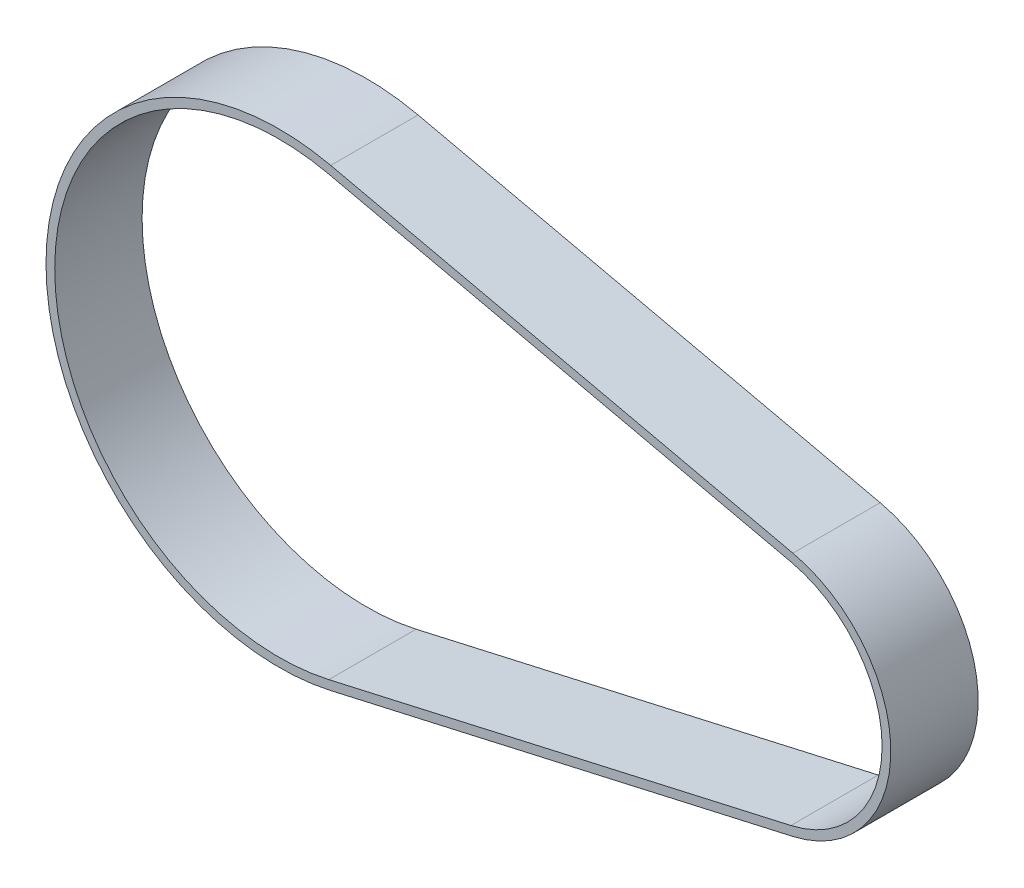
ISO-10303-21;
HEADER;
FILE_DESCRIPTION(('STEP AP214'),'2;1');
FILE_NAME('part.step','',(''),(''),'','','');
FILE_SCHEMA(('AUTOMOTIVE_DESIGN { 1 0 10303 214 1 1 1 1 }'));
ENDSEC;
DATA;
#1=APPLICATION_CONTEXT('core data for automotive mechanical design processes');
#2=APPLICATION_PROTOCOL_DEFINITION('international standard','automotive_design',2000,#1);
#3=PRODUCT_CONTEXT('',#1,'mechanical');
#4=PRODUCT('Part','Part','',(#3));
#5=PRODUCT_RELATED_PRODUCT_CATEGORY('part','',(#4));
#6=PRODUCT_DEFINITION_FORMATION('','',#4);
#7=PRODUCT_DEFINITION_CONTEXT('part definition',#1,'design');
#8=PRODUCT_DEFINITION('design','',#6,#7);
#9=PRODUCT_DEFINITION_SHAPE('','',#8);
#10=(LENGTH_UNIT() NAMED_UNIT(*) SI_UNIT(.MILLI.,.METRE.));
#11=(NAMED_UNIT(*) PLANE_ANGLE_UNIT() SI_UNIT($,.RADIAN.));
#12=(NAMED_UNIT(*) SI_UNIT($,.STERADIAN.) SOLID_ANGLE_UNIT());
#13=UNCERTAINTY_MEASURE_WITH_UNIT(LENGTH_MEASURE(1.E-05),#10,'distance_accuracy_value','');
#14=(GEOMETRIC_REPRESENTATION_CONTEXT(3) GLOBAL_UNCERTAINTY_ASSIGNED_CONTEXT((#13)) GLOBAL_UNIT_ASSIGNED_CONTEXT((#10,
#11,#12)) REPRESENTATION_CONTEXT('',''));
#15=CARTESIAN_POINT('',(0.,0.,0.));
#16=DIRECTION('',(0.,0.,1.));
#17=DIRECTION('',(1.,0.,0.));
#18=AXIS2_PLACEMENT_3D('',#15,#16,#17);
#19=CARTESIAN_POINT('',(0.,0.,0.));
#20=DIRECTION('',(0.,0.,1.));
#21=DIRECTION('',(1.,0.,0.));
#22=AXIS2_PLACEMENT_3D('',#19,#20,#21);
#23=CYLINDRICAL_SURFACE('',#22,26.6930054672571);
#24=CARTESIAN_POINT('',(0.,0.,10.));
#25=DIRECTION('',(0.,0.,1.));
#26=DIRECTION('',(1.,0.,0.));
#27=AXIS2_PLACEMENT_3D('',#24,#25,#26);
#28=CIRCLE('',#27,26.6930054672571);
#29=CARTESIAN_POINT('',(5.90067497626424,26.0326444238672,10.));
#30=VERTEX_POINT('',#29);
#31=CARTESIAN_POINT('',(5.90067497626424,-26.0326444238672,10.));
#32=VERTEX_POINT('',#31);
#33=EDGE_CURVE('E129',#30,#32,#28,.T.);
#34=ORIENTED_EDGE('',*,*,#33,.F.);
#35=DIRECTION('',(0.,0.,1.));
#36=VECTOR('',#35,1.);
#37=CARTESIAN_POINT('',(5.90067497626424,26.0326444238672,0.));
#38=LINE('',#37,#36);
#39=CARTESIAN_POINT('',(5.90067497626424,26.0326444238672,0.));
#40=VERTEX_POINT('',#39);
#41=EDGE_CURVE('E11',#40,#30,#38,.T.);
#42=ORIENTED_EDGE('',*,*,#41,.F.);
#43=CARTESIAN_POINT('',(0.,0.,0.));
#44=DIRECTION('',(0.,0.,1.));
#45=DIRECTION('',(1.,0.,0.));
#46=AXIS2_PLACEMENT_3D('',#43,#44,#45);
#47=CIRCLE('',#46,26.6930054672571);
#48=CARTESIAN_POINT('',(5.90067497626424,-26.0326444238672,0.));
#49=VERTEX_POINT('',#48);
#50=EDGE_CURVE('E133',#40,#49,#47,.T.);
#51=ORIENTED_EDGE('',*,*,#50,.T.);
#52=DIRECTION('',(0.,0.,1.));
#53=VECTOR('',#52,1.);
#54=CARTESIAN_POINT('',(5.90067497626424,-26.0326444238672,0.));
#55=LINE('',#54,#53);
#56=EDGE_CURVE('E34',#49,#32,#55,.T.);
#57=ORIENTED_EDGE('',*,*,#56,.T.);
#58=EDGE_LOOP('',(#34,#42,#51,#57));
#59=FACE_BOUND('',#58,.T.);
#60=ADVANCED_FACE('F31',(#59),#23,.T.);
#61=CARTESIAN_POINT('',(58.7992391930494,14.0424205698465,0.));
#62=DIRECTION('',(0.221056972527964,0.975260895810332,0.));
#63=DIRECTION('',(-0.975260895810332,0.221056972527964,0.));
#64=AXIS2_PLACEMENT_3D('',#61,#62,#63);
#65=PLANE('',#64);
#66=DIRECTION('',(-0.975260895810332,0.221056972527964,0.));
#67=VECTOR('',#66,1.);
#68=CARTESIAN_POINT('',(58.7992391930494,14.0424205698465,10.));
#69=LINE('',#68,#67);
#70=CARTESIAN_POINT('',(58.7992391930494,14.0424205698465,10.));
#71=VERTEX_POINT('',#70);
#72=EDGE_CURVE('E137',#71,#30,#69,.T.);
#73=ORIENTED_EDGE('',*,*,#72,.F.);
#74=DIRECTION('',(0.,0.,1.));
#75=VECTOR('',#74,1.);
#76=CARTESIAN_POINT('',(58.7992391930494,14.0424205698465,0.));
#77=LINE('',#76,#75);
#78=CARTESIAN_POINT('',(58.7992391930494,14.0424205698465,0.));
#79=VERTEX_POINT('',#78);
#80=EDGE_CURVE('E39',#79,#71,#77,.T.);
#81=ORIENTED_EDGE('',*,*,#80,.F.);
#82=DIRECTION('',(-0.975260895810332,0.221056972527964,0.));
#83=VECTOR('',#82,1.);
#84=CARTESIAN_POINT('',(58.7992391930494,14.0424205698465,0.));
#85=LINE('',#84,#83);
#86=EDGE_CURVE('E143',#79,#40,#85,.T.);
#87=ORIENTED_EDGE('',*,*,#86,.T.);
#88=ORIENTED_EDGE('',*,*,#41,.T.);
#89=EDGE_LOOP('',(#73,#81,#87,#88));
#90=FACE_BOUND('',#89,.T.);
#91=ADVANCED_FACE('F169',(#90),#65,.T.);
#92=CARTESIAN_POINT('',(55.6163216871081,0.,0.));
#93=DIRECTION('',(0.,0.,1.));
#94=DIRECTION('',(1.,0.,0.));
#95=AXIS2_PLACEMENT_3D('',#92,#93,#94);
#96=CYLINDRICAL_SURFACE('',#95,14.3986297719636);
#97=CARTESIAN_POINT('',(55.6163216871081,0.,10.));
#98=DIRECTION('',(0.,0.,1.));
#99=DIRECTION('',(1.,0.,0.));
#100=AXIS2_PLACEMENT_3D('',#97,#98,#99);
#101=CIRCLE('',#100,14.3986297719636);
#102=CARTESIAN_POINT('',(58.7992391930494,-14.0424205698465,10.));
#103=VERTEX_POINT('',#102);
#104=EDGE_CURVE('E151',#103,#71,#101,.T.);
#105=ORIENTED_EDGE('',*,*,#104,.F.);
#106=DIRECTION('',(0.,0.,1.));
#107=VECTOR('',#106,1.);
#108=CARTESIAN_POINT('',(58.7992391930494,-14.0424205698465,0.));
#109=LINE('',#108,#107);
#110=CARTESIAN_POINT('',(58.7992391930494,-14.0424205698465,0.));
#111=VERTEX_POINT('',#110);
#112=EDGE_CURVE('E156',#111,#103,#109,.T.);
#113=ORIENTED_EDGE('',*,*,#112,.F.);
#114=CARTESIAN_POINT('',(55.6163216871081,0.,0.));
#115=DIRECTION('',(0.,0.,1.));
#116=DIRECTION('',(1.,0.,0.));
#117=AXIS2_PLACEMENT_3D('',#114,#115,#116);
#118=CIRCLE('',#117,14.3986297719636);
#119=EDGE_CURVE('E140',#111,#79,#118,.T.);
#120=ORIENTED_EDGE('',*,*,#119,.T.);
#121=ORIENTED_EDGE('',*,*,#80,.T.);
#122=EDGE_LOOP('',(#105,#113,#120,#121));
#123=FACE_BOUND('',#122,.T.);
#124=ADVANCED_FACE('F173',(#123),#96,.T.);
#125=CARTESIAN_POINT('',(5.90067497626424,-26.0326444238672,0.));
#126=DIRECTION('',(0.221056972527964,-0.975260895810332,0.));
#127=DIRECTION('',(0.975260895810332,0.221056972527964,0.));
#128=AXIS2_PLACEMENT_3D('',#125,#126,#127);
#129=PLANE('',#128);
#130=DIRECTION('',(0.975260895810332,0.221056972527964,0.));
#131=VECTOR('',#130,1.);
#132=CARTESIAN_POINT('',(5.90067497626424,-26.0326444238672,10.));
#133=LINE('',#132,#131);
#134=EDGE_CURVE('E148',#32,#103,#133,.T.);
#135=ORIENTED_EDGE('',*,*,#134,.F.);
#136=ORIENTED_EDGE('',*,*,#56,.F.);
#137=DIRECTION('',(0.975260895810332,0.221056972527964,0.));
#138=VECTOR('',#137,1.);
#139=CARTESIAN_POINT('',(5.90067497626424,-26.0326444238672,0.));
#140=LINE('',#139,#138);
#141=EDGE_CURVE('E136',#49,#111,#140,.T.);
#142=ORIENTED_EDGE('',*,*,#141,.T.);
#143=ORIENTED_EDGE('',*,*,#112,.T.);
#144=EDGE_LOOP('',(#135,#136,#142,#143));
#145=FACE_BOUND('',#144,.T.);
#146=ADVANCED_FACE('F164',(#145),#129,.T.);
#147=CARTESIAN_POINT('',(0.,0.,0.));
#148=DIRECTION('',(0.,0.,1.));
#149=DIRECTION('',(1.,0.,0.));
#150=AXIS2_PLACEMENT_3D('',#147,#148,#149);
#151=PLANE('',#150);
#152=DIRECTION('',(-0.975260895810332,0.221056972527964,0.));
#153=VECTOR('',#152,1.);
#154=CARTESIAN_POINT('',(5.67961800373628,25.0573835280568,0.));
#155=LINE('',#154,#153);
#156=CARTESIAN_POINT('',(58.5781822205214,13.0671596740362,0.));
#157=VERTEX_POINT('',#156);
#158=CARTESIAN_POINT('',(5.67961800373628,25.0573835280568,0.));
#159=VERTEX_POINT('',#158);
#160=EDGE_CURVE('E104',#157,#159,#155,.T.);
#161=ORIENTED_EDGE('',*,*,#160,.T.);
#162=CARTESIAN_POINT('',(0.,0.,0.));
#163=DIRECTION('',(0.,0.,1.));
#164=DIRECTION('',(-1.,0.,0.));
#165=AXIS2_PLACEMENT_3D('',#162,#163,#164);
#166=CIRCLE('',#165,25.693005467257);
#167=CARTESIAN_POINT('',(5.67961800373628,-25.0573835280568,0.));
#168=VERTEX_POINT('',#167);
#169=EDGE_CURVE('E98',#159,#168,#166,.T.);
#170=ORIENTED_EDGE('',*,*,#169,.T.);
#171=DIRECTION('',(0.975260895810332,0.221056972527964,0.));
#172=VECTOR('',#171,1.);
#173=CARTESIAN_POINT('',(58.5781822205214,-13.0671596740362,0.));
#174=LINE('',#173,#172);
#175=CARTESIAN_POINT('',(58.5781822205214,-13.0671596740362,0.));
#176=VERTEX_POINT('',#175);
#177=EDGE_CURVE('E107',#168,#176,#174,.T.);
#178=ORIENTED_EDGE('',*,*,#177,.T.);
#179=CARTESIAN_POINT('',(55.6163216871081,0.,0.));
#180=DIRECTION('',(0.,0.,1.));
#181=DIRECTION('',(-1.,0.,0.));
#182=AXIS2_PLACEMENT_3D('',#179,#180,#181);
#183=CIRCLE('',#182,13.3986297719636);
#184=EDGE_CURVE('E47',#176,#157,#183,.T.);
#185=ORIENTED_EDGE('',*,*,#184,.T.);
#186=EDGE_LOOP('',(#161,#170,#178,#185));
#187=FACE_BOUND('',#186,.T.);
#188=ORIENTED_EDGE('',*,*,#50,.F.);
#189=ORIENTED_EDGE('',*,*,#86,.F.);
#190=ORIENTED_EDGE('',*,*,#119,.F.);
#191=ORIENTED_EDGE('',*,*,#141,.F.);
#192=EDGE_LOOP('',(#188,#189,#190,#191));
#193=FACE_BOUND('',#192,.T.);
#194=ADVANCED_FACE('F111',(#187,#193),#151,.F.);
#195=CARTESIAN_POINT('',(0.,0.,10.));
#196=DIRECTION('',(0.,0.,1.));
#197=DIRECTION('',(1.,0.,0.));
#198=AXIS2_PLACEMENT_3D('',#195,#196,#197);
#199=PLANE('',#198);
#200=CARTESIAN_POINT('',(0.,0.,10.));
#201=DIRECTION('',(0.,0.,1.));
#202=DIRECTION('',(-1.,0.,0.));
#203=AXIS2_PLACEMENT_3D('',#200,#201,#202);
#204=CIRCLE('',#203,25.693005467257);
#205=CARTESIAN_POINT('',(5.67961800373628,25.0573835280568,10.));
#206=VERTEX_POINT('',#205);
#207=CARTESIAN_POINT('',(5.67961800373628,-25.0573835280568,10.));
#208=VERTEX_POINT('',#207);
#209=EDGE_CURVE('E55',#206,#208,#204,.T.);
#210=ORIENTED_EDGE('',*,*,#209,.F.);
#211=DIRECTION('',(-0.975260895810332,0.221056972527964,0.));
#212=VECTOR('',#211,1.);
#213=CARTESIAN_POINT('',(5.67961800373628,25.0573835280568,10.));
#214=LINE('',#213,#212);
#215=CARTESIAN_POINT('',(58.5781822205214,13.0671596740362,10.));
#216=VERTEX_POINT('',#215);
#217=EDGE_CURVE('E114',#216,#206,#214,.T.);
#218=ORIENTED_EDGE('',*,*,#217,.F.);
#219=CARTESIAN_POINT('',(55.6163216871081,0.,10.));
#220=DIRECTION('',(0.,0.,1.));
#221=DIRECTION('',(-1.,0.,0.));
#222=AXIS2_PLACEMENT_3D('',#219,#220,#221);
#223=CIRCLE('',#222,13.3986297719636);
#224=CARTESIAN_POINT('',(58.5781822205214,-13.0671596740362,10.));
#225=VERTEX_POINT('',#224);
#226=EDGE_CURVE('E117',#225,#216,#223,.T.);
#227=ORIENTED_EDGE('',*,*,#226,.F.);
#228=DIRECTION('',(0.975260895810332,0.221056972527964,0.));
#229=VECTOR('',#228,1.);
#230=CARTESIAN_POINT('',(58.5781822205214,-13.0671596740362,10.));
#231=LINE('',#230,#229);
#232=EDGE_CURVE('E123',#208,#225,#231,.T.);
#233=ORIENTED_EDGE('',*,*,#232,.F.);
#234=EDGE_LOOP('',(#210,#218,#227,#233));
#235=FACE_BOUND('',#234,.T.);
#236=ORIENTED_EDGE('',*,*,#33,.T.);
#237=ORIENTED_EDGE('',*,*,#134,.T.);
#238=ORIENTED_EDGE('',*,*,#104,.T.);
#239=ORIENTED_EDGE('',*,*,#72,.T.);
#240=EDGE_LOOP('',(#236,#237,#238,#239));
#241=FACE_BOUND('',#240,.T.);
#242=ADVANCED_FACE('F166',(#235,#241),#199,.T.);
#243=CARTESIAN_POINT('',(0.,0.,0.));
#244=DIRECTION('',(0.,0.,1.));
#245=DIRECTION('',(1.,0.,0.));
#246=AXIS2_PLACEMENT_3D('',#243,#244,#245);
#247=CYLINDRICAL_SURFACE('',#246,25.693005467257);
#248=ORIENTED_EDGE('',*,*,#209,.T.);
#249=DIRECTION('',(0.,0.,1.));
#250=VECTOR('',#249,1.);
#251=CARTESIAN_POINT('',(5.67961800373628,-25.0573835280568,0.));
#252=LINE('',#251,#250);
#253=EDGE_CURVE('E94',#168,#208,#252,.T.);
#254=ORIENTED_EDGE('',*,*,#253,.F.);
#255=ORIENTED_EDGE('',*,*,#169,.F.);
#256=DIRECTION('',(0.,0.,1.));
#257=VECTOR('',#256,1.);
#258=CARTESIAN_POINT('',(5.67961800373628,25.0573835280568,0.));
#259=LINE('',#258,#257);
#260=EDGE_CURVE('E127',#159,#206,#259,.T.);
#261=ORIENTED_EDGE('',*,*,#260,.T.);
#262=EDGE_LOOP('',(#248,#254,#255,#261));
#263=FACE_BOUND('',#262,.T.);
#264=ADVANCED_FACE('F96',(#263),#247,.F.);
#265=CARTESIAN_POINT('',(5.67961800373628,25.0573835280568,0.));
#266=DIRECTION('',(0.221056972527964,0.975260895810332,0.));
#267=DIRECTION('',(-0.975260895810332,0.221056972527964,0.));
#268=AXIS2_PLACEMENT_3D('',#265,#266,#267);
#269=PLANE('',#268);
#270=ORIENTED_EDGE('',*,*,#217,.T.);
#271=ORIENTED_EDGE('',*,*,#260,.F.);
#272=ORIENTED_EDGE('',*,*,#160,.F.);
#273=DIRECTION('',(0.,0.,1.));
#274=VECTOR('',#273,1.);
#275=CARTESIAN_POINT('',(58.5781822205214,13.0671596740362,0.));
#276=LINE('',#275,#274);
#277=EDGE_CURVE('E130',#157,#216,#276,.T.);
#278=ORIENTED_EDGE('',*,*,#277,.T.);
#279=EDGE_LOOP('',(#270,#271,#272,#278));
#280=FACE_BOUND('',#279,.T.);
#281=ADVANCED_FACE('F224',(#280),#269,.F.);
#282=CARTESIAN_POINT('',(55.6163216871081,0.,0.));
#283=DIRECTION('',(0.,0.,1.));
#284=DIRECTION('',(1.,0.,0.));
#285=AXIS2_PLACEMENT_3D('',#282,#283,#284);
#286=CYLINDRICAL_SURFACE('',#285,13.3986297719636);
#287=ORIENTED_EDGE('',*,*,#226,.T.);
#288=ORIENTED_EDGE('',*,*,#277,.F.);
#289=ORIENTED_EDGE('',*,*,#184,.F.);
#290=DIRECTION('',(0.,0.,1.));
#291=VECTOR('',#290,1.);
#292=CARTESIAN_POINT('',(58.5781822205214,-13.0671596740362,0.));
#293=LINE('',#292,#291);
#294=EDGE_CURVE('E103',#176,#225,#293,.T.);
#295=ORIENTED_EDGE('',*,*,#294,.T.);
#296=EDGE_LOOP('',(#287,#288,#289,#295));
#297=FACE_BOUND('',#296,.T.);
#298=ADVANCED_FACE('F233',(#297),#286,.F.);
#299=CARTESIAN_POINT('',(58.5781822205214,-13.0671596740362,0.));
#300=DIRECTION('',(0.221056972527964,-0.975260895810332,0.));
#301=DIRECTION('',(0.975260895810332,0.221056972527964,0.));
#302=AXIS2_PLACEMENT_3D('',#299,#300,#301);
#303=PLANE('',#302);
#304=ORIENTED_EDGE('',*,*,#232,.T.);
#305=ORIENTED_EDGE('',*,*,#294,.F.);
#306=ORIENTED_EDGE('',*,*,#177,.F.);
#307=ORIENTED_EDGE('',*,*,#253,.T.);
#308=EDGE_LOOP('',(#304,#305,#306,#307));
#309=FACE_BOUND('',#308,.T.);
#310=ADVANCED_FACE('F108',(#309),#303,.F.);
#311=CLOSED_SHELL('',(#60,#91,#124,#146,#194,#242,#264,#281,#298,#310));
#312=MANIFOLD_SOLID_BREP('B2',#311);
#313=ADVANCED_BREP_SHAPE_REPRESENTATION('',(#18,#312),#14);
#314=SHAPE_DEFINITION_REPRESENTATION(#9,#313);
ENDSEC;
END-ISO-10303-21;
